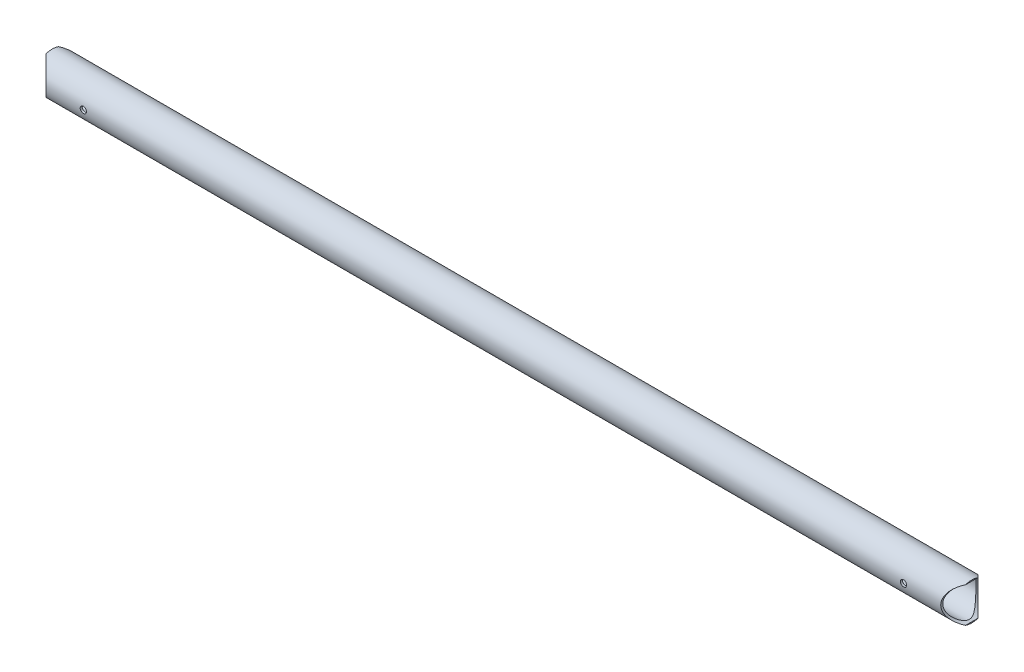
from build123d import *

# Parameters (mm, degrees)
SKETCH1_R           = 19.05
SKETCH1_R_2         = 16.9418
EXTRUDE1_DEPTH      = 469.9
EXTRUDE2_DEPTH      = 471.671663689
EXTRUDE2_DEPTH_BACK = 471.671663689
SKETCH2_R           = 19.05
EXTRUDE3_DEPTH      = 471.671663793
EXTRUDE3_DEPTH_BACK = 471.671663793
SKETCH3_R           = 3.175


with BuildPart() as part:
    # Sketch1 → Extrude1 (new, symmetric)
    with BuildSketch(Plane(origin=(0, 0, 0), x_dir=(0, 0, -1), z_dir=(1, 0, 0))):
        Circle(SKETCH1_R)
        Circle(SKETCH1_R_2, mode=Mode.SUBTRACT)
    extrude(amount=EXTRUDE1_DEPTH, both=True)

    # Sketch2 → Extrude2 (cut, two sides: drawn at the far end of the back side and taken through both)
    with BuildSketch(Plane.XY.offset(-EXTRUDE2_DEPTH_BACK)):
        with Locations((-476.25, 0)):
            Circle(SKETCH2_R)
        with Locations((476.25, 0)):
            Circle(SKETCH2_R)
    extrude(amount=EXTRUDE2_DEPTH + EXTRUDE2_DEPTH_BACK, mode=Mode.SUBTRACT)

    # Sketch3 → Extrude3 (cut, two sides: drawn at the far end of the back side and taken through both)
    with BuildSketch(Plane.XY.offset(-EXTRUDE3_DEPTH_BACK)):
        with Locations((-419.1, 0)):
            Circle(SKETCH3_R)
        with Locations((419.1, 0)):
            Circle(SKETCH3_R)
    extrude(amount=EXTRUDE3_DEPTH + EXTRUDE3_DEPTH_BACK, mode=Mode.SUBTRACT)


solid = part.part
